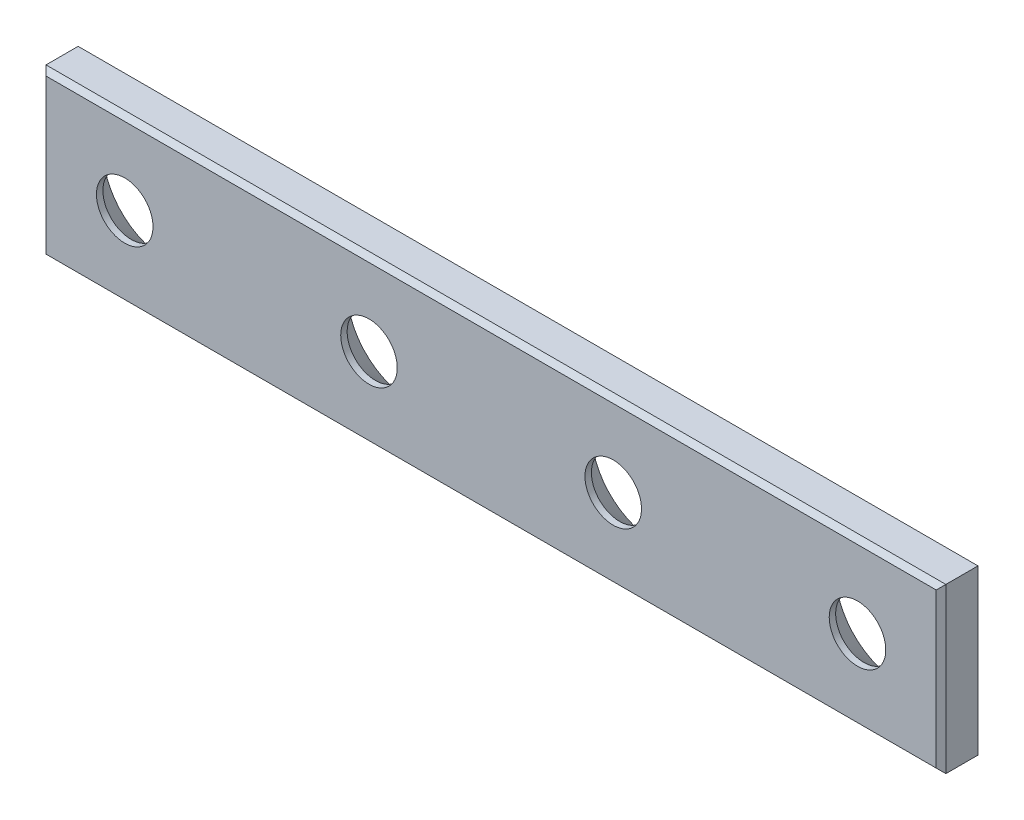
from build123d import *

# Parameters (mm, degrees)
SKETCH1_W          = 140
SKETCH1_H          = 25.5
EXTRUDE1_DEPTH     = 6.5
CHAMFER1_SIZE      = 0.75
SKETCH3_R          = 4.4
CUT_EXTRUDE1_DEPTH = 72.44797058
CHAMFER2_SIZE      = 5.5


with BuildPart() as part:
    # Sketch1 → Extrude1 (new body)
    with BuildSketch(Plane.XY):
        Rectangle(SKETCH1_W, SKETCH1_H)
    extrude(amount=EXTRUDE1_DEPTH)

    # Chamfer1
    chamfer1_edges = [part.edges().sort_by_distance(p)[0] for p in [
        (-70, 0, 6.5),
        (0, -12.75, 6.5),
        (70, 0, 6.5),
        (0, -12.75, 0),
        (-70, 0, 0),
        (0, 12.75, 0),
        (70, 0, 0),
        (0, 12.75, 6.5),
    ]]
    chamfer(chamfer1_edges, length=CHAMFER1_SIZE)

    # Sketch3 → Cut-Extrude1 (cut, through all)
    with BuildSketch(Plane(origin=(0, 0, 0), x_dir=(-1, 0, 0), z_dir=(0, 0, -1))):
        with Locations((57, 0)):
            Circle(SKETCH3_R)
        with Locations((19, 0)):
            Circle(SKETCH3_R)
        with Locations((-19, 0)):
            Circle(SKETCH3_R)
        with Locations((-57, 0)):
            Circle(SKETCH3_R)
    extrude(amount=-CUT_EXTRUDE1_DEPTH, mode=Mode.SUBTRACT)

    # Chamfer2
    chamfer2_edges = [part.edges().sort_by_distance(p)[0] for p in [
        (-52.6, 0, 0),
        (-14.6, 0, 0),
        (23.4, 0, 0),
        (61.4, 0, 0),
    ]]
    chamfer(chamfer2_edges, length=CHAMFER2_SIZE)


solid = part.part
